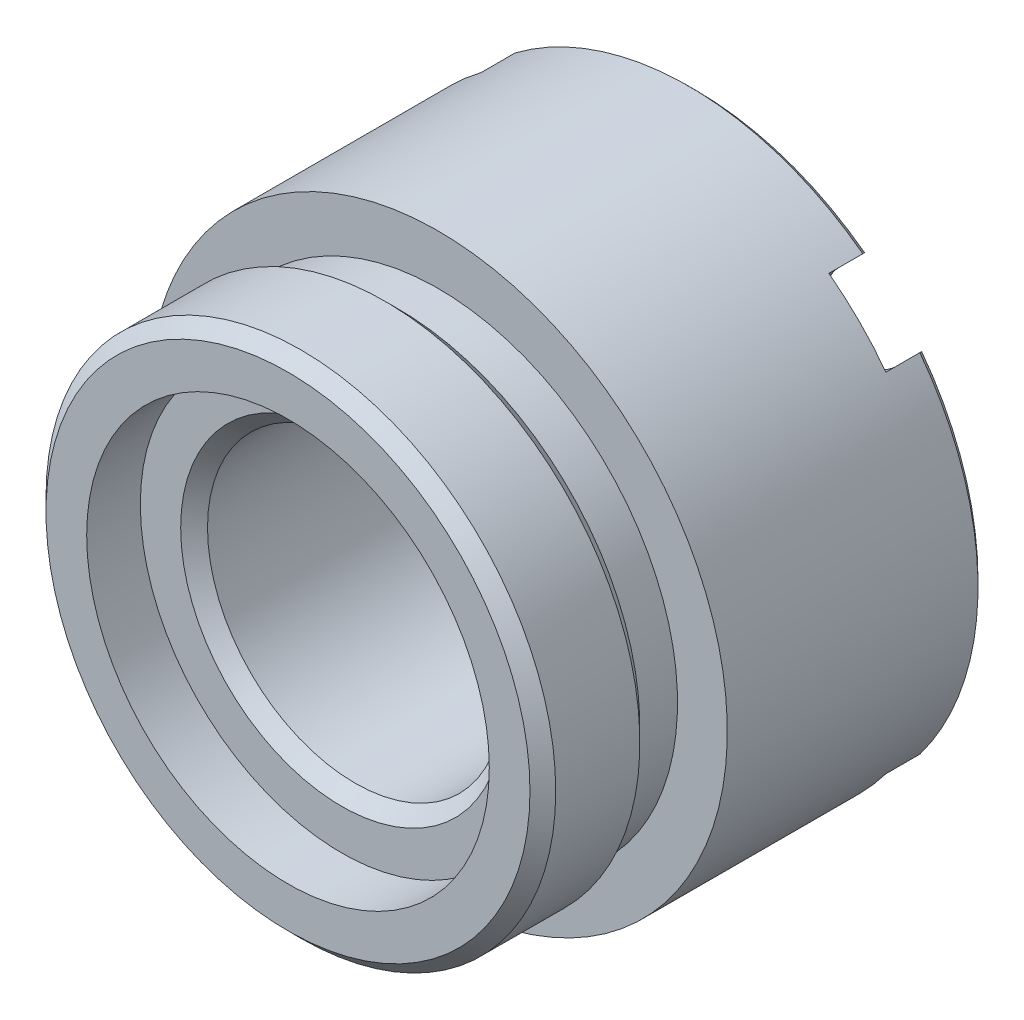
ISO-10303-21;
HEADER;
FILE_DESCRIPTION(('STEP AP214'),'2;1');
FILE_NAME('part.step','',(''),(''),'','','');
FILE_SCHEMA(('AUTOMOTIVE_DESIGN { 1 0 10303 214 1 1 1 1 }'));
ENDSEC;
DATA;
#1=APPLICATION_CONTEXT('core data for automotive mechanical design processes');
#2=APPLICATION_PROTOCOL_DEFINITION('international standard','automotive_design',2000,#1);
#3=PRODUCT_CONTEXT('',#1,'mechanical');
#4=PRODUCT('Part','Part','',(#3));
#5=PRODUCT_RELATED_PRODUCT_CATEGORY('part','',(#4));
#6=PRODUCT_DEFINITION_FORMATION('','',#4);
#7=PRODUCT_DEFINITION_CONTEXT('part definition',#1,'design');
#8=PRODUCT_DEFINITION('design','',#6,#7);
#9=PRODUCT_DEFINITION_SHAPE('','',#8);
#10=(LENGTH_UNIT() NAMED_UNIT(*) SI_UNIT(.MILLI.,.METRE.));
#11=(NAMED_UNIT(*) PLANE_ANGLE_UNIT() SI_UNIT($,.RADIAN.));
#12=(NAMED_UNIT(*) SI_UNIT($,.STERADIAN.) SOLID_ANGLE_UNIT());
#13=UNCERTAINTY_MEASURE_WITH_UNIT(LENGTH_MEASURE(1.E-05),#10,'distance_accuracy_value','');
#14=(GEOMETRIC_REPRESENTATION_CONTEXT(3) GLOBAL_UNCERTAINTY_ASSIGNED_CONTEXT((#13)) GLOBAL_UNIT_ASSIGNED_CONTEXT((#10,
#11,#12)) REPRESENTATION_CONTEXT('',''));
#15=CARTESIAN_POINT('',(0.,0.,0.));
#16=DIRECTION('',(0.,0.,1.));
#17=DIRECTION('',(1.,0.,0.));
#18=AXIS2_PLACEMENT_3D('',#15,#16,#17);
#19=CARTESIAN_POINT('',(0.,0.,-12.0523));
#20=DIRECTION('',(0.,0.,1.));
#21=DIRECTION('',(1.,0.,0.));
#22=AXIS2_PLACEMENT_3D('',#19,#20,#21);
#23=CONICAL_SURFACE('',#22,16.7259,0.785398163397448);
#24=CARTESIAN_POINT('',(10.0174456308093,13.3940219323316,-12.0525));
#25=CARTESIAN_POINT('',(10.0628537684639,13.4394300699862,-11.9889406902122));
#26=CARTESIAN_POINT('',(10.1082593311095,13.4848356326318,-11.9253777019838));
#27=CARTESIAN_POINT('',(10.1990653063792,13.5756416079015,-11.7982443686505));
#28=CARTESIAN_POINT('',(10.2444657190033,13.6210420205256,-11.7346740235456));
#29=CARTESIAN_POINT('',(10.2898635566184,13.6664398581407,-11.6711));
#30=B_SPLINE_CURVE_WITH_KNOTS('',3,(#24,#25,#26,#27,#28,#29),.UNSPECIFIED.,.F.,.F.,(4,2,4),(0.,
0.271057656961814,0.542115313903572),.UNSPECIFIED.);
#31=CARTESIAN_POINT('',(10.0175885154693,13.3941648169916,-12.0523));
#32=VERTEX_POINT('',#31);
#33=CARTESIAN_POINT('',(10.2897207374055,13.6662970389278,-11.6713));
#34=VERTEX_POINT('',#33);
#35=EDGE_CURVE('E208',#32,#34,#30,.T.);
#36=ORIENTED_EDGE('',*,*,#35,.F.);
#37=CARTESIAN_POINT('',(0.,0.,-12.0523));
#38=DIRECTION('',(0.,0.,-1.));
#39=DIRECTION('',(-1.,0.,0.));
#40=AXIS2_PLACEMENT_3D('',#37,#38,#39);
#41=CIRCLE('',#40,16.7259);
#42=CARTESIAN_POINT('',(-10.0175885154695,13.3941648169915,-12.0523));
#43=VERTEX_POINT('',#42);
#44=EDGE_CURVE('E248',#43,#32,#41,.T.);
#45=ORIENTED_EDGE('',*,*,#44,.F.);
#46=CARTESIAN_POINT('',(-10.2898635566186,13.6664398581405,-11.6711));
#47=CARTESIAN_POINT('',(-10.2444657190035,13.6210420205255,-11.7346740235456));
#48=CARTESIAN_POINT('',(-10.1990653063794,13.5756416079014,-11.7982443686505));
#49=CARTESIAN_POINT('',(-10.1082593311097,13.4848356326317,-11.9253777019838));
#50=CARTESIAN_POINT('',(-10.0628537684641,13.4394300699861,-11.9889406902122));
#51=CARTESIAN_POINT('',(-10.0174456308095,13.3940219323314,-12.0525));
#52=B_SPLINE_CURVE_WITH_KNOTS('',3,(#46,#47,#48,#49,#50,#51),.UNSPECIFIED.,.F.,.F.,(4,2,4),(0.,
0.271057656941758,0.542115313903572),.UNSPECIFIED.);
#53=CARTESIAN_POINT('',(-10.2897207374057,13.6662970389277,-11.6713));
#54=VERTEX_POINT('',#53);
#55=EDGE_CURVE('E46',#54,#43,#52,.T.);
#56=ORIENTED_EDGE('',*,*,#55,.F.);
#57=CARTESIAN_POINT('',(0.,0.,-11.6713));
#58=DIRECTION('',(0.,0.,-1.));
#59=DIRECTION('',(-1.,0.,0.));
#60=AXIS2_PLACEMENT_3D('',#57,#58,#59);
#61=CIRCLE('',#60,17.1069);
#62=EDGE_CURVE('E404',#34,#54,#61,.F.);
#63=ORIENTED_EDGE('',*,*,#62,.F.);
#64=EDGE_LOOP('',(#36,#45,#56,#63));
#65=FACE_BOUND('',#64,.T.);
#66=ADVANCED_FACE('F33',(#65),#23,.T.);
#67=CARTESIAN_POINT('',(13.6664398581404,10.2898635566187,-11.6711));
#68=CARTESIAN_POINT('',(13.6210420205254,10.2444657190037,-11.7346740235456));
#69=CARTESIAN_POINT('',(13.5756416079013,10.1990653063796,-11.7982443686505));
#70=CARTESIAN_POINT('',(13.4848356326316,10.1082593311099,-11.9253777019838));
#71=CARTESIAN_POINT('',(13.439430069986,10.0628537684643,-11.9889406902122));
#72=CARTESIAN_POINT('',(13.3940219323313,10.0174456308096,-12.0525));
#73=B_SPLINE_CURVE_WITH_KNOTS('',3,(#67,#68,#69,#70,#71,#72),.UNSPECIFIED.,.F.,.F.,(4,2,4),(0.,
0.271057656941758,0.542115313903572),.UNSPECIFIED.);
#74=CARTESIAN_POINT('',(13.6662970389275,10.2897207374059,-11.6713));
#75=VERTEX_POINT('',#74);
#76=CARTESIAN_POINT('',(13.3941648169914,10.0175885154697,-12.0523));
#77=VERTEX_POINT('',#76);
#78=EDGE_CURVE('E231',#75,#77,#73,.T.);
#79=ORIENTED_EDGE('',*,*,#78,.F.);
#80=CARTESIAN_POINT('',(13.6662970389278,-10.2897207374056,-11.6713));
#81=VERTEX_POINT('',#80);
#82=EDGE_CURVE('E197',#81,#75,#61,.F.);
#83=ORIENTED_EDGE('',*,*,#82,.F.);
#84=CARTESIAN_POINT('',(13.3940219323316,-10.0174456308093,-12.0525));
#85=CARTESIAN_POINT('',(13.4394300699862,-10.062853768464,-11.9889406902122));
#86=CARTESIAN_POINT('',(13.4848356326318,-10.1082593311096,-11.9253777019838));
#87=CARTESIAN_POINT('',(13.5756416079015,-10.1990653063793,-11.7982443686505));
#88=CARTESIAN_POINT('',(13.6210420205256,-10.2444657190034,-11.7346740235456));
#89=CARTESIAN_POINT('',(13.6664398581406,-10.2898635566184,-11.6711));
#90=B_SPLINE_CURVE_WITH_KNOTS('',3,(#84,#85,#86,#87,#88,#89),.UNSPECIFIED.,.F.,.F.,(4,2,4),(0.,
0.271057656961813,0.542115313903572),.UNSPECIFIED.);
#91=CARTESIAN_POINT('',(13.3941648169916,-10.0175885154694,-12.0523));
#92=VERTEX_POINT('',#91);
#93=EDGE_CURVE('E284',#92,#81,#90,.T.);
#94=ORIENTED_EDGE('',*,*,#93,.F.);
#95=EDGE_CURVE('E405',#77,#92,#41,.T.);
#96=ORIENTED_EDGE('',*,*,#95,.F.);
#97=EDGE_LOOP('',(#79,#83,#94,#96));
#98=FACE_BOUND('',#97,.T.);
#99=ADVANCED_FACE('F452',(#98),#23,.T.);
#100=CARTESIAN_POINT('',(10.2898635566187,-13.6664398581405,-11.6711));
#101=CARTESIAN_POINT('',(10.2444657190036,-13.6210420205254,-11.7346740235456));
#102=CARTESIAN_POINT('',(10.1990653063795,-13.5756416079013,-11.7982443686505));
#103=CARTESIAN_POINT('',(10.1082593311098,-13.4848356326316,-11.9253777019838));
#104=CARTESIAN_POINT('',(10.0628537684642,-13.439430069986,-11.9889406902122));
#105=CARTESIAN_POINT('',(10.0174456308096,-13.3940219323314,-12.0525));
#106=B_SPLINE_CURVE_WITH_KNOTS('',3,(#100,#101,#102,#103,#104,#105),.UNSPECIFIED.,.F.,.F.,(4,2,
4),(0.,0.271057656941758,0.542115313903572),.UNSPECIFIED.);
#107=CARTESIAN_POINT('',(10.2897207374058,-13.6662970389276,-11.6713));
#108=VERTEX_POINT('',#107);
#109=CARTESIAN_POINT('',(10.0175885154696,-13.3941648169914,-12.0523));
#110=VERTEX_POINT('',#109);
#111=EDGE_CURVE('E259',#108,#110,#106,.T.);
#112=ORIENTED_EDGE('',*,*,#111,.F.);
#113=CARTESIAN_POINT('',(-10.2897207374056,-13.6662970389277,-11.6713));
#114=VERTEX_POINT('',#113);
#115=EDGE_CURVE('E410',#114,#108,#61,.F.);
#116=ORIENTED_EDGE('',*,*,#115,.F.);
#117=CARTESIAN_POINT('',(-10.0174456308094,-13.3940219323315,-12.0525));
#118=CARTESIAN_POINT('',(-10.062853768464,-13.4394300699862,-11.9889406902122));
#119=CARTESIAN_POINT('',(-10.1082593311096,-13.4848356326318,-11.9253777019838));
#120=CARTESIAN_POINT('',(-10.1990653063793,-13.5756416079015,-11.7982443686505));
#121=CARTESIAN_POINT('',(-10.2444657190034,-13.6210420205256,-11.7346740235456));
#122=CARTESIAN_POINT('',(-10.2898635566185,-13.6664398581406,-11.6711));
#123=B_SPLINE_CURVE_WITH_KNOTS('',3,(#117,#118,#119,#120,#121,#122),.UNSPECIFIED.,.F.,.F.,(4,2,
4),(0.,0.271057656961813,0.542115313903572),.UNSPECIFIED.);
#124=CARTESIAN_POINT('',(-10.0175885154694,-13.3941648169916,-12.0523));
#125=VERTEX_POINT('',#124);
#126=EDGE_CURVE('E330',#125,#114,#123,.T.);
#127=ORIENTED_EDGE('',*,*,#126,.F.);
#128=EDGE_CURVE('E490',#110,#125,#41,.T.);
#129=ORIENTED_EDGE('',*,*,#128,.F.);
#130=EDGE_LOOP('',(#112,#116,#127,#129));
#131=FACE_BOUND('',#130,.T.);
#132=ADVANCED_FACE('F448',(#131),#23,.T.);
#133=CARTESIAN_POINT('',(0.,0.,-12.0523));
#134=DIRECTION('',(0.,0.,-1.));
#135=DIRECTION('',(-1.,0.,0.));
#136=AXIS2_PLACEMENT_3D('',#133,#134,#135);
#137=PLANE('',#136);
#138=DIRECTION('',(0.707106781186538,0.707106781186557,0.));
#139=VECTOR('',#138,1.);
#140=CARTESIAN_POINT('',(10.2897207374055,13.6662970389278,-12.0523));
#141=LINE('',#140,#139);
#142=CARTESIAN_POINT('',(8.45042100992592,11.8269973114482,-12.0523));
#143=VERTEX_POINT('',#142);
#144=EDGE_CURVE('E245',#143,#32,#141,.T.);
#145=ORIENTED_EDGE('',*,*,#144,.F.);
#146=CARTESIAN_POINT('',(10.1387091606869,10.1387091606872,-12.0523));
#147=DIRECTION('',(0.,0.,-1.));
#148=DIRECTION('',(0.,1.,0.));
#149=AXIS2_PLACEMENT_3D('',#146,#147,#148);
#150=CIRCLE('',#149,2.3876);
#151=CARTESIAN_POINT('',(11.826997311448,8.45042100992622,-12.0523));
#152=VERTEX_POINT('',#151);
#153=EDGE_CURVE('E198',#152,#143,#150,.T.);
#154=ORIENTED_EDGE('',*,*,#153,.F.);
#155=DIRECTION('',(-0.707106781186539,-0.707106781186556,0.));
#156=VECTOR('',#155,1.);
#157=CARTESIAN_POINT('',(13.6662970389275,10.2897207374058,-12.0523));
#158=LINE('',#157,#156);
#159=EDGE_CURVE('E202',#77,#152,#158,.T.);
#160=ORIENTED_EDGE('',*,*,#159,.F.);
#161=ORIENTED_EDGE('',*,*,#95,.T.);
#162=DIRECTION('',(0.707106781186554,-0.707106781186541,0.));
#163=VECTOR('',#162,1.);
#164=CARTESIAN_POINT('',(13.6662970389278,-10.2897207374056,-12.0523));
#165=LINE('',#164,#163);
#166=CARTESIAN_POINT('',(11.8269973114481,-8.45042100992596,-12.0523));
#167=VERTEX_POINT('',#166);
#168=EDGE_CURVE('E293',#167,#92,#165,.T.);
#169=ORIENTED_EDGE('',*,*,#168,.F.);
#170=CARTESIAN_POINT('',(10.1387091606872,-10.138709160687,-12.0523));
#171=DIRECTION('',(0.,0.,-1.));
#172=DIRECTION('',(1.,0.,0.));
#173=AXIS2_PLACEMENT_3D('',#170,#171,#172);
#174=CIRCLE('',#173,2.3876);
#175=CARTESIAN_POINT('',(8.45042100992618,-11.826997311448,-12.0523));
#176=VERTEX_POINT('',#175);
#177=EDGE_CURVE('E507',#176,#167,#174,.T.);
#178=ORIENTED_EDGE('',*,*,#177,.F.);
#179=DIRECTION('',(-0.707106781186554,0.707106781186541,0.));
#180=VECTOR('',#179,1.);
#181=CARTESIAN_POINT('',(10.2897207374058,-13.6662970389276,-12.0523));
#182=LINE('',#181,#180);
#183=EDGE_CURVE('E266',#110,#176,#182,.T.);
#184=ORIENTED_EDGE('',*,*,#183,.F.);
#185=ORIENTED_EDGE('',*,*,#128,.T.);
#186=DIRECTION('',(-0.707106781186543,-0.707106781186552,0.));
#187=VECTOR('',#186,1.);
#188=CARTESIAN_POINT('',(-10.2897207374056,-13.6662970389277,-12.0523));
#189=LINE('',#188,#187);
#190=CARTESIAN_POINT('',(-8.45042100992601,-11.8269973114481,-12.0523));
#191=VERTEX_POINT('',#190);
#192=EDGE_CURVE('E341',#191,#125,#189,.T.);
#193=ORIENTED_EDGE('',*,*,#192,.F.);
#194=CARTESIAN_POINT('',(-10.138709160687,-10.1387091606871,-12.0523));
#195=DIRECTION('',(0.,0.,-1.));
#196=DIRECTION('',(0.,-1.,0.));
#197=AXIS2_PLACEMENT_3D('',#194,#195,#196);
#198=CIRCLE('',#197,2.3876);
#199=CARTESIAN_POINT('',(-11.826997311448,-8.45042100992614,-12.0523));
#200=VERTEX_POINT('',#199);
#201=EDGE_CURVE('E479',#200,#191,#198,.T.);
#202=ORIENTED_EDGE('',*,*,#201,.F.);
#203=DIRECTION('',(0.707106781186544,0.707106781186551,0.));
#204=VECTOR('',#203,1.);
#205=CARTESIAN_POINT('',(-13.6662970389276,-10.2897207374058,-12.0523));
#206=LINE('',#205,#204);
#207=CARTESIAN_POINT('',(-13.3941648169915,-10.0175885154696,-12.0523));
#208=VERTEX_POINT('',#207);
#209=EDGE_CURVE('E311',#208,#200,#206,.T.);
#210=ORIENTED_EDGE('',*,*,#209,.F.);
#211=CARTESIAN_POINT('',(-13.3941648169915,10.0175885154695,-12.0523));
#212=VERTEX_POINT('',#211);
#213=EDGE_CURVE('E402',#208,#212,#41,.T.);
#214=ORIENTED_EDGE('',*,*,#213,.T.);
#215=DIRECTION('',(-0.70710678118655,0.707106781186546,0.));
#216=VECTOR('',#215,1.);
#217=CARTESIAN_POINT('',(-13.6662970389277,10.2897207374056,-12.0523));
#218=LINE('',#217,#216);
#219=CARTESIAN_POINT('',(-11.8269973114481,8.45042100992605,-12.0523));
#220=VERTEX_POINT('',#219);
#221=EDGE_CURVE('E349',#220,#212,#218,.T.);
#222=ORIENTED_EDGE('',*,*,#221,.F.);
#223=CARTESIAN_POINT('',(-10.1387091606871,10.138709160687,-12.0523));
#224=DIRECTION('',(0.,0.,-1.));
#225=DIRECTION('',(-1.,0.,0.));
#226=AXIS2_PLACEMENT_3D('',#223,#224,#225);
#227=CIRCLE('',#226,2.3876);
#228=CARTESIAN_POINT('',(-8.4504210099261,11.826997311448,-12.0523));
#229=VERTEX_POINT('',#228);
#230=EDGE_CURVE('E346',#229,#220,#227,.T.);
#231=ORIENTED_EDGE('',*,*,#230,.F.);
#232=DIRECTION('',(0.707106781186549,-0.707106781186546,0.));
#233=VECTOR('',#232,1.);
#234=CARTESIAN_POINT('',(-10.2897207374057,13.6662970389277,-12.0523));
#235=LINE('',#234,#233);
#236=EDGE_CURVE('E344',#43,#229,#235,.T.);
#237=ORIENTED_EDGE('',*,*,#236,.F.);
#238=ORIENTED_EDGE('',*,*,#44,.T.);
#239=EDGE_LOOP('',(#145,#154,#160,#161,#169,#178,#184,#185,#193,#202,#210,#214,#222,#231,#237,#238));
#240=FACE_BOUND('',#239,.T.);
#241=CARTESIAN_POINT('',(0.,0.,-12.0523));
#242=DIRECTION('',(0.,0.,-1.));
#243=DIRECTION('',(-1.,0.,0.));
#244=AXIS2_PLACEMENT_3D('',#241,#242,#243);
#245=CIRCLE('',#244,9.52499999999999);
#246=CARTESIAN_POINT('',(-9.52499999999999,0.,-12.0523));
#247=VERTEX_POINT('',#246);
#248=EDGE_CURVE('E390',#247,#247,#245,.F.);
#249=ORIENTED_EDGE('',*,*,#248,.T.);
#250=EDGE_LOOP('',(#249));
#251=FACE_BOUND('',#250,.T.);
#252=ADVANCED_FACE('F35',(#240,#251),#137,.T.);
#253=CARTESIAN_POINT('',(0.,0.,-63.7141652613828));
#254=DIRECTION('',(0.,0.,-1.));
#255=DIRECTION('',(-1.,0.,0.));
#256=AXIS2_PLACEMENT_3D('',#253,#254,#255);
#257=CYLINDRICAL_SURFACE('',#256,17.1069);
#258=DIRECTION('',(0.,0.,-1.));
#259=VECTOR('',#258,1.);
#260=CARTESIAN_POINT('',(10.2897207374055,13.6662970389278,-9.6647));
#261=LINE('',#260,#259);
#262=CARTESIAN_POINT('',(10.2897207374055,13.6662970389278,-9.6647));
#263=VERTEX_POINT('',#262);
#264=EDGE_CURVE('E53',#263,#34,#261,.T.);
#265=ORIENTED_EDGE('',*,*,#264,.T.);
#266=ORIENTED_EDGE('',*,*,#62,.T.);
#267=DIRECTION('',(0.,0.,-1.));
#268=VECTOR('',#267,1.);
#269=CARTESIAN_POINT('',(-10.2897207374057,13.6662970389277,-9.6647));
#270=LINE('',#269,#268);
#271=CARTESIAN_POINT('',(-10.2897207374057,13.6662970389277,-9.6647));
#272=VERTEX_POINT('',#271);
#273=EDGE_CURVE('E364',#272,#54,#270,.T.);
#274=ORIENTED_EDGE('',*,*,#273,.F.);
#275=CARTESIAN_POINT('',(0.,0.,-9.6647));
#276=DIRECTION('',(0.,0.,-1.));
#277=DIRECTION('',(-1.,0.,0.));
#278=AXIS2_PLACEMENT_3D('',#275,#276,#277);
#279=CIRCLE('',#278,17.1069);
#280=CARTESIAN_POINT('',(-13.6662970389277,10.2897207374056,-9.6647));
#281=VERTEX_POINT('',#280);
#282=EDGE_CURVE('E352',#281,#272,#279,.T.);
#283=ORIENTED_EDGE('',*,*,#282,.F.);
#284=DIRECTION('',(0.,0.,-1.));
#285=VECTOR('',#284,1.);
#286=CARTESIAN_POINT('',(-13.6662970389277,10.2897207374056,-9.6647));
#287=LINE('',#286,#285);
#288=CARTESIAN_POINT('',(-13.6662970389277,10.2897207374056,-11.6713));
#289=VERTEX_POINT('',#288);
#290=EDGE_CURVE('E365',#281,#289,#287,.T.);
#291=ORIENTED_EDGE('',*,*,#290,.T.);
#292=CARTESIAN_POINT('',(-13.6662970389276,-10.2897207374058,-11.6713));
#293=VERTEX_POINT('',#292);
#294=EDGE_CURVE('E406',#289,#293,#61,.F.);
#295=ORIENTED_EDGE('',*,*,#294,.T.);
#296=DIRECTION('',(0.,0.,-1.));
#297=VECTOR('',#296,1.);
#298=CARTESIAN_POINT('',(-13.6662970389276,-10.2897207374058,-9.6647));
#299=LINE('',#298,#297);
#300=CARTESIAN_POINT('',(-13.6662970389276,-10.2897207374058,-9.6647));
#301=VERTEX_POINT('',#300);
#302=EDGE_CURVE('E475',#301,#293,#299,.T.);
#303=ORIENTED_EDGE('',*,*,#302,.F.);
#304=CARTESIAN_POINT('',(0.,0.,-9.6647));
#305=DIRECTION('',(0.,0.,-1.));
#306=DIRECTION('',(0.,-1.,0.));
#307=AXIS2_PLACEMENT_3D('',#304,#305,#306);
#308=CIRCLE('',#307,17.1069);
#309=CARTESIAN_POINT('',(-10.2897207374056,-13.6662970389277,-9.6647));
#310=VERTEX_POINT('',#309);
#311=EDGE_CURVE('E296',#310,#301,#308,.T.);
#312=ORIENTED_EDGE('',*,*,#311,.F.);
#313=DIRECTION('',(0.,0.,-1.));
#314=VECTOR('',#313,1.);
#315=CARTESIAN_POINT('',(-10.2897207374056,-13.6662970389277,-9.6647));
#316=LINE('',#315,#314);
#317=EDGE_CURVE('E336',#310,#114,#316,.T.);
#318=ORIENTED_EDGE('',*,*,#317,.T.);
#319=ORIENTED_EDGE('',*,*,#115,.T.);
#320=DIRECTION('',(0.,0.,-1.));
#321=VECTOR('',#320,1.);
#322=CARTESIAN_POINT('',(10.2897207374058,-13.6662970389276,-9.6647));
#323=LINE('',#322,#321);
#324=CARTESIAN_POINT('',(10.2897207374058,-13.6662970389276,-9.6647));
#325=VERTEX_POINT('',#324);
#326=EDGE_CURVE('E502',#325,#108,#323,.T.);
#327=ORIENTED_EDGE('',*,*,#326,.F.);
#328=CARTESIAN_POINT('',(0.,0.,-9.6647));
#329=DIRECTION('',(0.,0.,-1.));
#330=DIRECTION('',(1.,0.,0.));
#331=AXIS2_PLACEMENT_3D('',#328,#329,#330);
#332=CIRCLE('',#331,17.1069);
#333=CARTESIAN_POINT('',(13.6662970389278,-10.2897207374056,-9.6647));
#334=VERTEX_POINT('',#333);
#335=EDGE_CURVE('E250',#334,#325,#332,.T.);
#336=ORIENTED_EDGE('',*,*,#335,.F.);
#337=DIRECTION('',(0.,0.,-1.));
#338=VECTOR('',#337,1.);
#339=CARTESIAN_POINT('',(13.6662970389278,-10.2897207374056,-9.6647));
#340=LINE('',#339,#338);
#341=EDGE_CURVE('E61',#334,#81,#340,.T.);
#342=ORIENTED_EDGE('',*,*,#341,.T.);
#343=ORIENTED_EDGE('',*,*,#82,.T.);
#344=DIRECTION('',(0.,0.,-1.));
#345=VECTOR('',#344,1.);
#346=CARTESIAN_POINT('',(13.6662970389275,10.2897207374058,-9.6647));
#347=LINE('',#346,#345);
#348=CARTESIAN_POINT('',(13.6662970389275,10.2897207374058,-9.6647));
#349=VERTEX_POINT('',#348);
#350=EDGE_CURVE('E187',#349,#75,#347,.T.);
#351=ORIENTED_EDGE('',*,*,#350,.F.);
#352=CARTESIAN_POINT('',(0.,0.,-9.6647));
#353=DIRECTION('',(0.,0.,-1.));
#354=DIRECTION('',(0.,1.,0.));
#355=AXIS2_PLACEMENT_3D('',#352,#353,#354);
#356=CIRCLE('',#355,17.1069);
#357=EDGE_CURVE('E175',#263,#349,#356,.T.);
#358=ORIENTED_EDGE('',*,*,#357,.F.);
#359=EDGE_LOOP('',(#265,#266,#274,#283,#291,#295,#303,#312,#318,#319,#327,#336,#342,#343,#351,#358));
#360=FACE_BOUND('',#359,.T.);
#361=CARTESIAN_POINT('',(0.,0.,3.16230000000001));
#362=DIRECTION('',(0.,0.,-1.));
#363=DIRECTION('',(-1.,0.,0.));
#364=AXIS2_PLACEMENT_3D('',#361,#362,#363);
#365=CIRCLE('',#364,17.1069);
#366=CARTESIAN_POINT('',(-17.1069,0.,3.16230000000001));
#367=VERTEX_POINT('',#366);
#368=EDGE_CURVE('E387',#367,#367,#365,.T.);
#369=ORIENTED_EDGE('',*,*,#368,.T.);
#370=EDGE_LOOP('',(#369));
#371=FACE_BOUND('',#370,.T.);
#372=ADVANCED_FACE('F194',(#360,#371),#257,.T.);
#373=CARTESIAN_POINT('',(0.,17.1069,3.1623));
#374=DIRECTION('',(0.,0.,1.));
#375=DIRECTION('',(1.,0.,0.));
#376=AXIS2_PLACEMENT_3D('',#373,#374,#375);
#377=PLANE('',#376);
#378=CARTESIAN_POINT('',(0.,0.,3.16229999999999));
#379=DIRECTION('',(0.,0.,-1.));
#380=DIRECTION('',(-1.,0.,0.));
#381=AXIS2_PLACEMENT_3D('',#378,#379,#380);
#382=CIRCLE('',#381,14.1605);
#383=CARTESIAN_POINT('',(-14.1605,0.,3.16229999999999));
#384=VERTEX_POINT('',#383);
#385=EDGE_CURVE('E384',#384,#384,#382,.T.);
#386=ORIENTED_EDGE('',*,*,#385,.T.);
#387=EDGE_LOOP('',(#386));
#388=FACE_BOUND('',#387,.T.);
#389=ORIENTED_EDGE('',*,*,#368,.F.);
#390=EDGE_LOOP('',(#389));
#391=FACE_BOUND('',#390,.T.);
#392=ADVANCED_FACE('F714',(#388,#391),#377,.T.);
#393=CARTESIAN_POINT('',(0.,0.,-63.7141652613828));
#394=DIRECTION('',(0.,0.,-1.));
#395=DIRECTION('',(-1.,0.,0.));
#396=AXIS2_PLACEMENT_3D('',#393,#394,#395);
#397=CYLINDRICAL_SURFACE('',#396,14.1605);
#398=CARTESIAN_POINT('',(0.,0.,5.5499));
#399=DIRECTION('',(0.,0.,-1.));
#400=DIRECTION('',(-1.,0.,0.));
#401=AXIS2_PLACEMENT_3D('',#398,#399,#400);
#402=CIRCLE('',#401,14.1605);
#403=CARTESIAN_POINT('',(-14.1605,0.,5.5499));
#404=VERTEX_POINT('',#403);
#405=EDGE_CURVE('E381',#404,#404,#402,.T.);
#406=ORIENTED_EDGE('',*,*,#405,.T.);
#407=EDGE_LOOP('',(#406));
#408=FACE_BOUND('',#407,.T.);
#409=ORIENTED_EDGE('',*,*,#385,.F.);
#410=EDGE_LOOP('',(#409));
#411=FACE_BOUND('',#410,.T.);
#412=ADVANCED_FACE('F706',(#408,#411),#397,.T.);
#413=CARTESIAN_POINT('',(0.,14.1605,5.5499));
#414=DIRECTION('',(0.,0.,-1.));
#415=DIRECTION('',(-1.,0.,0.));
#416=AXIS2_PLACEMENT_3D('',#413,#414,#415);
#417=PLANE('',#416);
#418=CARTESIAN_POINT('',(0.,0.,5.5499));
#419=DIRECTION('',(0.,0.,-1.));
#420=DIRECTION('',(-1.,0.,0.));
#421=AXIS2_PLACEMENT_3D('',#418,#419,#420);
#422=CIRCLE('',#421,14.31925);
#423=CARTESIAN_POINT('',(-14.31925,0.,5.5499));
#424=VERTEX_POINT('',#423);
#425=EDGE_CURVE('E419',#424,#424,#422,.T.);
#426=ORIENTED_EDGE('',*,*,#425,.T.);
#427=EDGE_LOOP('',(#426));
#428=FACE_BOUND('',#427,.T.);
#429=ORIENTED_EDGE('',*,*,#405,.F.);
#430=EDGE_LOOP('',(#429));
#431=FACE_BOUND('',#430,.T.);
#432=ADVANCED_FACE('F698',(#428,#431),#417,.T.);
#433=CARTESIAN_POINT('',(0.,0.,-63.7141652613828));
#434=DIRECTION('',(0.,0.,-1.));
#435=DIRECTION('',(-1.,0.,0.));
#436=AXIS2_PLACEMENT_3D('',#433,#434,#435);
#437=CYLINDRICAL_SURFACE('',#436,15.08125);
#438=CARTESIAN_POINT('',(0.,0.,11.2903));
#439=DIRECTION('',(0.,0.,1.));
#440=DIRECTION('',(1.,0.,0.));
#441=AXIS2_PLACEMENT_3D('',#438,#439,#440);
#442=CIRCLE('',#441,15.08125);
#443=CARTESIAN_POINT('',(15.08125,0.,11.2903));
#444=VERTEX_POINT('',#443);
#445=EDGE_CURVE('E413',#444,#444,#442,.F.);
#446=ORIENTED_EDGE('',*,*,#445,.T.);
#447=EDGE_LOOP('',(#446));
#448=FACE_BOUND('',#447,.T.);
#449=CARTESIAN_POINT('',(0.,0.,6.3119));
#450=DIRECTION('',(0.,0.,-1.));
#451=DIRECTION('',(-1.,0.,0.));
#452=AXIS2_PLACEMENT_3D('',#449,#450,#451);
#453=CIRCLE('',#452,15.08125);
#454=CARTESIAN_POINT('',(-15.08125,0.,6.3119));
#455=VERTEX_POINT('',#454);
#456=EDGE_CURVE('E409',#455,#455,#453,.F.);
#457=ORIENTED_EDGE('',*,*,#456,.T.);
#458=EDGE_LOOP('',(#457));
#459=FACE_BOUND('',#458,.T.);
#460=ADVANCED_FACE('F689',(#448,#459),#437,.T.);
#461=CARTESIAN_POINT('',(0.,15.08125,12.0523));
#462=DIRECTION('',(0.,0.,1.));
#463=DIRECTION('',(1.,0.,0.));
#464=AXIS2_PLACEMENT_3D('',#461,#462,#463);
#465=PLANE('',#464);
#466=CARTESIAN_POINT('',(0.,0.,12.0523));
#467=DIRECTION('',(0.,0.,1.));
#468=DIRECTION('',(1.,0.,0.));
#469=AXIS2_PLACEMENT_3D('',#466,#467,#468);
#470=CIRCLE('',#469,14.31925);
#471=CARTESIAN_POINT('',(14.31925,0.,12.0523));
#472=VERTEX_POINT('',#471);
#473=EDGE_CURVE('E416',#472,#472,#470,.T.);
#474=ORIENTED_EDGE('',*,*,#473,.T.);
#475=EDGE_LOOP('',(#474));
#476=FACE_BOUND('',#475,.T.);
#477=CARTESIAN_POINT('',(0.,0.,12.0523));
#478=DIRECTION('',(0.,0.,1.));
#479=DIRECTION('',(1.,0.,0.));
#480=AXIS2_PLACEMENT_3D('',#477,#478,#479);
#481=CIRCLE('',#480,11.9126);
#482=CARTESIAN_POINT('',(11.9126,0.,12.0523));
#483=VERTEX_POINT('',#482);
#484=EDGE_CURVE('E368',#483,#483,#481,.T.);
#485=ORIENTED_EDGE('',*,*,#484,.F.);
#486=EDGE_LOOP('',(#485));
#487=FACE_BOUND('',#486,.T.);
#488=ADVANCED_FACE('F681',(#476,#487),#465,.T.);
#489=CARTESIAN_POINT('',(0.,0.,8.8773));
#490=DIRECTION('',(0.,0.,-1.));
#491=DIRECTION('',(-1.,0.,0.));
#492=AXIS2_PLACEMENT_3D('',#489,#490,#491);
#493=PLANE('',#492);
#494=CARTESIAN_POINT('',(0.,0.,8.8773));
#495=DIRECTION('',(0.,0.,-1.));
#496=DIRECTION('',(-1.,0.,0.));
#497=AXIS2_PLACEMENT_3D('',#494,#495,#496);
#498=CIRCLE('',#497,9.52499999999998);
#499=CARTESIAN_POINT('',(-9.52499999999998,0.,8.8773));
#500=VERTEX_POINT('',#499);
#501=EDGE_CURVE('E399',#500,#500,#498,.T.);
#502=ORIENTED_EDGE('',*,*,#501,.T.);
#503=EDGE_LOOP('',(#502));
#504=FACE_BOUND('',#503,.T.);
#505=CARTESIAN_POINT('',(0.,0.,8.8773));
#506=DIRECTION('',(0.,0.,1.));
#507=DIRECTION('',(1.,0.,0.));
#508=AXIS2_PLACEMENT_3D('',#505,#506,#507);
#509=CIRCLE('',#508,11.9126);
#510=CARTESIAN_POINT('',(11.9126,0.,8.8773));
#511=VERTEX_POINT('',#510);
#512=EDGE_CURVE('E378',#511,#511,#509,.T.);
#513=ORIENTED_EDGE('',*,*,#512,.T.);
#514=EDGE_LOOP('',(#513));
#515=FACE_BOUND('',#514,.T.);
#516=ADVANCED_FACE('F672',(#504,#515),#493,.F.);
#517=CARTESIAN_POINT('',(0.,0.,12.0523));
#518=DIRECTION('',(0.,0.,1.));
#519=DIRECTION('',(1.,0.,0.));
#520=AXIS2_PLACEMENT_3D('',#517,#518,#519);
#521=CYLINDRICAL_SURFACE('',#520,11.9126);
#522=ORIENTED_EDGE('',*,*,#512,.F.);
#523=EDGE_LOOP('',(#522));
#524=FACE_BOUND('',#523,.T.);
#525=ORIENTED_EDGE('',*,*,#484,.T.);
#526=EDGE_LOOP('',(#525));
#527=FACE_BOUND('',#526,.T.);
#528=ADVANCED_FACE('F662',(#524,#527),#521,.F.);
#529=CARTESIAN_POINT('',(0.,0.,8.8773));
#530=DIRECTION('',(0.,0.,1.));
#531=DIRECTION('',(1.,0.,0.));
#532=AXIS2_PLACEMENT_3D('',#529,#530,#531);
#533=CYLINDRICAL_SURFACE('',#532,8.73124999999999);
#534=CARTESIAN_POINT('',(0.,0.,-11.25855));
#535=DIRECTION('',(0.,0.,-1.));
#536=DIRECTION('',(-1.,0.,0.));
#537=AXIS2_PLACEMENT_3D('',#534,#535,#536);
#538=CIRCLE('',#537,8.73124999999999);
#539=CARTESIAN_POINT('',(-8.73124999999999,0.,-11.25855));
#540=VERTEX_POINT('',#539);
#541=EDGE_CURVE('E396',#540,#540,#538,.T.);
#542=ORIENTED_EDGE('',*,*,#541,.T.);
#543=EDGE_LOOP('',(#542));
#544=FACE_BOUND('',#543,.T.);
#545=CARTESIAN_POINT('',(0.,0.,8.08355));
#546=DIRECTION('',(0.,0.,-1.));
#547=DIRECTION('',(-1.,0.,0.));
#548=AXIS2_PLACEMENT_3D('',#545,#546,#547);
#549=CIRCLE('',#548,8.73124999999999);
#550=CARTESIAN_POINT('',(-8.73124999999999,0.,8.08355));
#551=VERTEX_POINT('',#550);
#552=EDGE_CURVE('E393',#551,#551,#549,.F.);
#553=ORIENTED_EDGE('',*,*,#552,.T.);
#554=EDGE_LOOP('',(#553));
#555=FACE_BOUND('',#554,.T.);
#556=ADVANCED_FACE('F653',(#544,#555),#533,.F.);
#557=CARTESIAN_POINT('',(0.,0.,-12.0523));
#558=DIRECTION('',(0.,0.,-1.));
#559=DIRECTION('',(-1.,0.,0.));
#560=AXIS2_PLACEMENT_3D('',#557,#558,#559);
#561=CONICAL_SURFACE('',#560,9.52499999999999,0.785398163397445);
#562=ORIENTED_EDGE('',*,*,#541,.F.);
#563=EDGE_LOOP('',(#562));
#564=FACE_BOUND('',#563,.T.);
#565=ORIENTED_EDGE('',*,*,#248,.F.);
#566=EDGE_LOOP('',(#565));
#567=FACE_BOUND('',#566,.T.);
#568=ADVANCED_FACE('F644',(#564,#567),#561,.F.);
#569=CARTESIAN_POINT('',(0.,0.,8.08355));
#570=DIRECTION('',(0.,0.,1.));
#571=DIRECTION('',(1.,0.,0.));
#572=AXIS2_PLACEMENT_3D('',#569,#570,#571);
#573=CONICAL_SURFACE('',#572,8.73124999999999,0.785398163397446);
#574=ORIENTED_EDGE('',*,*,#501,.F.);
#575=EDGE_LOOP('',(#574));
#576=FACE_BOUND('',#575,.T.);
#577=ORIENTED_EDGE('',*,*,#552,.F.);
#578=EDGE_LOOP('',(#577));
#579=FACE_BOUND('',#578,.T.);
#580=ADVANCED_FACE('F446',(#576,#579),#573,.F.);
#581=CARTESIAN_POINT('',(-13.6664398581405,-10.2898635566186,-11.6711));
#582=CARTESIAN_POINT('',(-13.6210420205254,-10.2444657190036,-11.7346740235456));
#583=CARTESIAN_POINT('',(-13.5756416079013,-10.1990653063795,-11.7982443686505));
#584=CARTESIAN_POINT('',(-13.4848356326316,-10.1082593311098,-11.9253777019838));
#585=CARTESIAN_POINT('',(-13.4394300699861,-10.0628537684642,-11.9889406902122));
#586=CARTESIAN_POINT('',(-13.3940219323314,-10.0174456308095,-12.0525));
#587=B_SPLINE_CURVE_WITH_KNOTS('',3,(#581,#582,#583,#584,#585,#586),.UNSPECIFIED.,.F.,.F.,(4,2,
4),(0.,0.271057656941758,0.542115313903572),.UNSPECIFIED.);
#588=EDGE_CURVE('E304',#293,#208,#587,.T.);
#589=ORIENTED_EDGE('',*,*,#588,.F.);
#590=ORIENTED_EDGE('',*,*,#294,.F.);
#591=CARTESIAN_POINT('',(-13.3940219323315,10.0174456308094,-12.0525));
#592=CARTESIAN_POINT('',(-13.4394300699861,10.0628537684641,-11.9889406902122));
#593=CARTESIAN_POINT('',(-13.4848356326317,10.1082593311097,-11.9253777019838));
#594=CARTESIAN_POINT('',(-13.5756416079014,10.1990653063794,-11.7982443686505));
#595=CARTESIAN_POINT('',(-13.6210420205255,10.2444657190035,-11.7346740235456));
#596=CARTESIAN_POINT('',(-13.6664398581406,10.2898635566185,-11.6711));
#597=B_SPLINE_CURVE_WITH_KNOTS('',3,(#591,#592,#593,#594,#595,#596),.UNSPECIFIED.,.F.,.F.,(4,2,
4),(0.,0.271057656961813,0.542115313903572),.UNSPECIFIED.);
#598=EDGE_CURVE('E11',#212,#289,#597,.T.);
#599=ORIENTED_EDGE('',*,*,#598,.F.);
#600=ORIENTED_EDGE('',*,*,#213,.F.);
#601=EDGE_LOOP('',(#589,#590,#599,#600));
#602=FACE_BOUND('',#601,.T.);
#603=ADVANCED_FACE('F425',(#602),#23,.T.);
#604=CARTESIAN_POINT('',(0.,0.,11.2903));
#605=DIRECTION('',(0.,0.,-1.));
#606=DIRECTION('',(-1.,0.,0.));
#607=AXIS2_PLACEMENT_3D('',#604,#605,#606);
#608=CONICAL_SURFACE('',#607,15.08125,0.785398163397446);
#609=ORIENTED_EDGE('',*,*,#473,.F.);
#610=EDGE_LOOP('',(#609));
#611=FACE_BOUND('',#610,.T.);
#612=ORIENTED_EDGE('',*,*,#445,.F.);
#613=EDGE_LOOP('',(#612));
#614=FACE_BOUND('',#613,.T.);
#615=ADVANCED_FACE('F439',(#611,#614),#608,.T.);
#616=CARTESIAN_POINT('',(0.,0.,5.5499));
#617=DIRECTION('',(0.,0.,1.));
#618=DIRECTION('',(1.,0.,0.));
#619=AXIS2_PLACEMENT_3D('',#616,#617,#618);
#620=CONICAL_SURFACE('',#619,14.31925,0.785398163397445);
#621=ORIENTED_EDGE('',*,*,#456,.F.);
#622=EDGE_LOOP('',(#621));
#623=FACE_BOUND('',#622,.T.);
#624=ORIENTED_EDGE('',*,*,#425,.F.);
#625=EDGE_LOOP('',(#624));
#626=FACE_BOUND('',#625,.T.);
#627=ADVANCED_FACE('F436',(#623,#626),#620,.T.);
#628=CARTESIAN_POINT('',(-13.6662970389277,10.2897207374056,-9.6647));
#629=DIRECTION('',(-0.707106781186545,-0.707106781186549,0.));
#630=DIRECTION('',(0.70710678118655,-0.707106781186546,0.));
#631=AXIS2_PLACEMENT_3D('',#628,#629,#630);
#632=PLANE('',#631);
#633=ORIENTED_EDGE('',*,*,#598,.T.);
#634=ORIENTED_EDGE('',*,*,#290,.F.);
#635=DIRECTION('',(-0.70710678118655,0.707106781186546,0.));
#636=VECTOR('',#635,1.);
#637=CARTESIAN_POINT('',(-13.6662970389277,10.2897207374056,-9.6647));
#638=LINE('',#637,#636);
#639=CARTESIAN_POINT('',(-11.8269973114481,8.45042100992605,-9.6647));
#640=VERTEX_POINT('',#639);
#641=EDGE_CURVE('E361',#640,#281,#638,.T.);
#642=ORIENTED_EDGE('',*,*,#641,.F.);
#643=DIRECTION('',(0.,0.,-1.));
#644=VECTOR('',#643,1.);
#645=CARTESIAN_POINT('',(-11.8269973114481,8.45042100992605,-9.6647));
#646=LINE('',#645,#644);
#647=EDGE_CURVE('E369',#640,#220,#646,.T.);
#648=ORIENTED_EDGE('',*,*,#647,.T.);
#649=ORIENTED_EDGE('',*,*,#221,.T.);
#650=EDGE_LOOP('',(#633,#634,#642,#648,#649));
#651=FACE_BOUND('',#650,.T.);
#652=ADVANCED_FACE('F438',(#651),#632,.F.);
#653=CARTESIAN_POINT('',(-10.1387091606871,10.138709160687,-9.6647));
#654=DIRECTION('',(0.,0.,-1.));
#655=DIRECTION('',(-1.,0.,0.));
#656=AXIS2_PLACEMENT_3D('',#653,#654,#655);
#657=CYLINDRICAL_SURFACE('',#656,2.3876);
#658=ORIENTED_EDGE('',*,*,#230,.T.);
#659=ORIENTED_EDGE('',*,*,#647,.F.);
#660=CARTESIAN_POINT('',(-10.1387091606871,10.138709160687,-9.6647));
#661=DIRECTION('',(0.,0.,-1.));
#662=DIRECTION('',(-1.,0.,0.));
#663=AXIS2_PLACEMENT_3D('',#660,#661,#662);
#664=CIRCLE('',#663,2.3876);
#665=CARTESIAN_POINT('',(-8.4504210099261,11.826997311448,-9.6647));
#666=VERTEX_POINT('',#665);
#667=EDGE_CURVE('E358',#666,#640,#664,.T.);
#668=ORIENTED_EDGE('',*,*,#667,.F.);
#669=DIRECTION('',(0.,0.,-1.));
#670=VECTOR('',#669,1.);
#671=CARTESIAN_POINT('',(-8.4504210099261,11.826997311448,-9.6647));
#672=LINE('',#671,#670);
#673=EDGE_CURVE('E371',#666,#229,#672,.T.);
#674=ORIENTED_EDGE('',*,*,#673,.T.);
#675=EDGE_LOOP('',(#658,#659,#668,#674));
#676=FACE_BOUND('',#675,.T.);
#677=ADVANCED_FACE('F434',(#676),#657,.F.);
#678=CARTESIAN_POINT('',(-10.2897207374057,13.6662970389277,-9.6647));
#679=DIRECTION('',(0.707106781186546,0.707106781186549,0.));
#680=DIRECTION('',(-0.707106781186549,0.707106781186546,0.));
#681=AXIS2_PLACEMENT_3D('',#678,#679,#680);
#682=PLANE('',#681);
#683=ORIENTED_EDGE('',*,*,#55,.T.);
#684=ORIENTED_EDGE('',*,*,#236,.T.);
#685=ORIENTED_EDGE('',*,*,#673,.F.);
#686=DIRECTION('',(0.707106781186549,-0.707106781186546,0.));
#687=VECTOR('',#686,1.);
#688=CARTESIAN_POINT('',(-10.2897207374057,13.6662970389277,-9.6647));
#689=LINE('',#688,#687);
#690=EDGE_CURVE('E355',#272,#666,#689,.T.);
#691=ORIENTED_EDGE('',*,*,#690,.F.);
#692=ORIENTED_EDGE('',*,*,#273,.T.);
#693=EDGE_LOOP('',(#683,#684,#685,#691,#692));
#694=FACE_BOUND('',#693,.T.);
#695=ADVANCED_FACE('F429',(#694),#682,.F.);
#696=CARTESIAN_POINT('',(0.,0.,-9.6647));
#697=DIRECTION('',(0.,0.,-1.));
#698=DIRECTION('',(-1.,0.,0.));
#699=AXIS2_PLACEMENT_3D('',#696,#697,#698);
#700=PLANE('',#699);
#701=ORIENTED_EDGE('',*,*,#282,.T.);
#702=ORIENTED_EDGE('',*,*,#690,.T.);
#703=ORIENTED_EDGE('',*,*,#667,.T.);
#704=ORIENTED_EDGE('',*,*,#641,.T.);
#705=EDGE_LOOP('',(#701,#702,#703,#704));
#706=FACE_BOUND('',#705,.T.);
#707=ADVANCED_FACE('F327',(#706),#700,.T.);
#708=CARTESIAN_POINT('',(-10.2897207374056,-13.6662970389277,-9.6647));
#709=DIRECTION('',(0.707106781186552,-0.707106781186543,0.));
#710=DIRECTION('',(0.707106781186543,0.707106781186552,0.));
#711=AXIS2_PLACEMENT_3D('',#708,#709,#710);
#712=PLANE('',#711);
#713=ORIENTED_EDGE('',*,*,#126,.T.);
#714=ORIENTED_EDGE('',*,*,#317,.F.);
#715=DIRECTION('',(-0.707106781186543,-0.707106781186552,0.));
#716=VECTOR('',#715,1.);
#717=CARTESIAN_POINT('',(-10.2897207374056,-13.6662970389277,-9.6647));
#718=LINE('',#717,#716);
#719=CARTESIAN_POINT('',(-8.45042100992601,-11.8269973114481,-9.6647));
#720=VERTEX_POINT('',#719);
#721=EDGE_CURVE('E302',#720,#310,#718,.T.);
#722=ORIENTED_EDGE('',*,*,#721,.F.);
#723=DIRECTION('',(0.,0.,-1.));
#724=VECTOR('',#723,1.);
#725=CARTESIAN_POINT('',(-8.45042100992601,-11.8269973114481,-9.6647));
#726=LINE('',#725,#724);
#727=EDGE_CURVE('E337',#720,#191,#726,.T.);
#728=ORIENTED_EDGE('',*,*,#727,.T.);
#729=ORIENTED_EDGE('',*,*,#192,.T.);
#730=EDGE_LOOP('',(#713,#714,#722,#728,#729));
#731=FACE_BOUND('',#730,.T.);
#732=ADVANCED_FACE('F323',(#731),#712,.F.);
#733=CARTESIAN_POINT('',(-10.138709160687,-10.1387091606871,-9.6647));
#734=DIRECTION('',(0.,0.,-1.));
#735=DIRECTION('',(0.,-1.,0.));
#736=AXIS2_PLACEMENT_3D('',#733,#734,#735);
#737=CYLINDRICAL_SURFACE('',#736,2.3876);
#738=ORIENTED_EDGE('',*,*,#201,.T.);
#739=ORIENTED_EDGE('',*,*,#727,.F.);
#740=CARTESIAN_POINT('',(-10.138709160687,-10.1387091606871,-9.6647));
#741=DIRECTION('',(0.,0.,-1.));
#742=DIRECTION('',(0.,-1.,0.));
#743=AXIS2_PLACEMENT_3D('',#740,#741,#742);
#744=CIRCLE('',#743,2.3876);
#745=CARTESIAN_POINT('',(-11.826997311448,-8.45042100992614,-9.6647));
#746=VERTEX_POINT('',#745);
#747=EDGE_CURVE('E300',#746,#720,#744,.T.);
#748=ORIENTED_EDGE('',*,*,#747,.F.);
#749=DIRECTION('',(0.,0.,-1.));
#750=VECTOR('',#749,1.);
#751=CARTESIAN_POINT('',(-11.826997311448,-8.45042100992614,-9.6647));
#752=LINE('',#751,#750);
#753=EDGE_CURVE('E480',#746,#200,#752,.T.);
#754=ORIENTED_EDGE('',*,*,#753,.T.);
#755=EDGE_LOOP('',(#738,#739,#748,#754));
#756=FACE_BOUND('',#755,.T.);
#757=ADVANCED_FACE('F320',(#756),#737,.F.);
#758=CARTESIAN_POINT('',(-13.6662970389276,-10.2897207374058,-9.6647));
#759=DIRECTION('',(-0.707106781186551,0.707106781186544,0.));
#760=DIRECTION('',(-0.707106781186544,-0.707106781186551,0.));
#761=AXIS2_PLACEMENT_3D('',#758,#759,#760);
#762=PLANE('',#761);
#763=ORIENTED_EDGE('',*,*,#588,.T.);
#764=ORIENTED_EDGE('',*,*,#209,.T.);
#765=ORIENTED_EDGE('',*,*,#753,.F.);
#766=DIRECTION('',(0.707106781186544,0.707106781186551,0.));
#767=VECTOR('',#766,1.);
#768=CARTESIAN_POINT('',(-13.6662970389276,-10.2897207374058,-9.6647));
#769=LINE('',#768,#767);
#770=EDGE_CURVE('E298',#301,#746,#769,.T.);
#771=ORIENTED_EDGE('',*,*,#770,.F.);
#772=ORIENTED_EDGE('',*,*,#302,.T.);
#773=EDGE_LOOP('',(#763,#764,#765,#771,#772));
#774=FACE_BOUND('',#773,.T.);
#775=ADVANCED_FACE('F316',(#774),#762,.F.);
#776=CARTESIAN_POINT('',(0.,0.,-9.6647));
#777=DIRECTION('',(0.,0.,-1.));
#778=DIRECTION('',(0.,-1.,0.));
#779=AXIS2_PLACEMENT_3D('',#776,#777,#778);
#780=PLANE('',#779);
#781=ORIENTED_EDGE('',*,*,#311,.T.);
#782=ORIENTED_EDGE('',*,*,#770,.T.);
#783=ORIENTED_EDGE('',*,*,#747,.T.);
#784=ORIENTED_EDGE('',*,*,#721,.T.);
#785=EDGE_LOOP('',(#781,#782,#783,#784));
#786=FACE_BOUND('',#785,.T.);
#787=ADVANCED_FACE('F282',(#786),#780,.T.);
#788=CARTESIAN_POINT('',(13.6662970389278,-10.2897207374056,-9.6647));
#789=DIRECTION('',(0.707106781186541,0.707106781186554,0.));
#790=DIRECTION('',(-0.707106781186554,0.707106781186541,0.));
#791=AXIS2_PLACEMENT_3D('',#788,#789,#790);
#792=PLANE('',#791);
#793=ORIENTED_EDGE('',*,*,#93,.T.);
#794=ORIENTED_EDGE('',*,*,#341,.F.);
#795=DIRECTION('',(0.707106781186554,-0.707106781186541,0.));
#796=VECTOR('',#795,1.);
#797=CARTESIAN_POINT('',(13.6662970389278,-10.2897207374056,-9.6647));
#798=LINE('',#797,#796);
#799=CARTESIAN_POINT('',(11.8269973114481,-8.45042100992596,-9.6647));
#800=VERTEX_POINT('',#799);
#801=EDGE_CURVE('E257',#800,#334,#798,.T.);
#802=ORIENTED_EDGE('',*,*,#801,.F.);
#803=DIRECTION('',(0.,0.,-1.));
#804=VECTOR('',#803,1.);
#805=CARTESIAN_POINT('',(11.8269973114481,-8.45042100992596,-9.6647));
#806=LINE('',#805,#804);
#807=EDGE_CURVE('E290',#800,#167,#806,.T.);
#808=ORIENTED_EDGE('',*,*,#807,.T.);
#809=ORIENTED_EDGE('',*,*,#168,.T.);
#810=EDGE_LOOP('',(#793,#794,#802,#808,#809));
#811=FACE_BOUND('',#810,.T.);
#812=ADVANCED_FACE('F278',(#811),#792,.F.);
#813=CARTESIAN_POINT('',(10.1387091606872,-10.138709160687,-9.6647));
#814=DIRECTION('',(0.,0.,-1.));
#815=DIRECTION('',(1.,0.,0.));
#816=AXIS2_PLACEMENT_3D('',#813,#814,#815);
#817=CYLINDRICAL_SURFACE('',#816,2.3876);
#818=ORIENTED_EDGE('',*,*,#177,.T.);
#819=ORIENTED_EDGE('',*,*,#807,.F.);
#820=CARTESIAN_POINT('',(10.1387091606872,-10.138709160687,-9.6647));
#821=DIRECTION('',(0.,0.,-1.));
#822=DIRECTION('',(1.,0.,0.));
#823=AXIS2_PLACEMENT_3D('',#820,#821,#822);
#824=CIRCLE('',#823,2.3876);
#825=CARTESIAN_POINT('',(8.45042100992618,-11.826997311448,-9.6647));
#826=VERTEX_POINT('',#825);
#827=EDGE_CURVE('E255',#826,#800,#824,.T.);
#828=ORIENTED_EDGE('',*,*,#827,.F.);
#829=DIRECTION('',(0.,0.,-1.));
#830=VECTOR('',#829,1.);
#831=CARTESIAN_POINT('',(8.45042100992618,-11.826997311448,-9.6647));
#832=LINE('',#831,#830);
#833=EDGE_CURVE('E508',#826,#176,#832,.T.);
#834=ORIENTED_EDGE('',*,*,#833,.T.);
#835=EDGE_LOOP('',(#818,#819,#828,#834));
#836=FACE_BOUND('',#835,.T.);
#837=ADVANCED_FACE('F275',(#836),#817,.F.);
#838=CARTESIAN_POINT('',(10.2897207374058,-13.6662970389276,-9.6647));
#839=DIRECTION('',(-0.707106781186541,-0.707106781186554,0.));
#840=DIRECTION('',(0.707106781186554,-0.707106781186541,0.));
#841=AXIS2_PLACEMENT_3D('',#838,#839,#840);
#842=PLANE('',#841);
#843=ORIENTED_EDGE('',*,*,#111,.T.);
#844=ORIENTED_EDGE('',*,*,#183,.T.);
#845=ORIENTED_EDGE('',*,*,#833,.F.);
#846=DIRECTION('',(-0.707106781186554,0.707106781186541,0.));
#847=VECTOR('',#846,1.);
#848=CARTESIAN_POINT('',(10.2897207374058,-13.6662970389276,-9.6647));
#849=LINE('',#848,#847);
#850=EDGE_CURVE('E251',#325,#826,#849,.T.);
#851=ORIENTED_EDGE('',*,*,#850,.F.);
#852=ORIENTED_EDGE('',*,*,#326,.T.);
#853=EDGE_LOOP('',(#843,#844,#845,#851,#852));
#854=FACE_BOUND('',#853,.T.);
#855=ADVANCED_FACE('F271',(#854),#842,.F.);
#856=CARTESIAN_POINT('',(0.,0.,-9.6647));
#857=DIRECTION('',(0.,0.,-1.));
#858=DIRECTION('',(1.,0.,0.));
#859=AXIS2_PLACEMENT_3D('',#856,#857,#858);
#860=PLANE('',#859);
#861=ORIENTED_EDGE('',*,*,#335,.T.);
#862=ORIENTED_EDGE('',*,*,#850,.T.);
#863=ORIENTED_EDGE('',*,*,#827,.T.);
#864=ORIENTED_EDGE('',*,*,#801,.T.);
#865=EDGE_LOOP('',(#861,#862,#863,#864));
#866=FACE_BOUND('',#865,.T.);
#867=ADVANCED_FACE('F223',(#866),#860,.T.);
#868=CARTESIAN_POINT('',(10.2897207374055,13.6662970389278,-9.6647));
#869=DIRECTION('',(-0.707106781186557,0.707106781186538,0.));
#870=DIRECTION('',(-0.707106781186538,-0.707106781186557,0.));
#871=AXIS2_PLACEMENT_3D('',#868,#869,#870);
#872=PLANE('',#871);
#873=ORIENTED_EDGE('',*,*,#35,.T.);
#874=ORIENTED_EDGE('',*,*,#264,.F.);
#875=DIRECTION('',(0.707106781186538,0.707106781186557,0.));
#876=VECTOR('',#875,1.);
#877=CARTESIAN_POINT('',(10.2897207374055,13.6662970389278,-9.6647));
#878=LINE('',#877,#876);
#879=CARTESIAN_POINT('',(8.45042100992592,11.8269973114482,-9.6647));
#880=VERTEX_POINT('',#879);
#881=EDGE_CURVE('E180',#880,#263,#878,.T.);
#882=ORIENTED_EDGE('',*,*,#881,.F.);
#883=DIRECTION('',(0.,0.,-1.));
#884=VECTOR('',#883,1.);
#885=CARTESIAN_POINT('',(8.45042100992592,11.8269973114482,-9.6647));
#886=LINE('',#885,#884);
#887=EDGE_CURVE('E200',#880,#143,#886,.T.);
#888=ORIENTED_EDGE('',*,*,#887,.T.);
#889=ORIENTED_EDGE('',*,*,#144,.T.);
#890=EDGE_LOOP('',(#873,#874,#882,#888,#889));
#891=FACE_BOUND('',#890,.T.);
#892=ADVANCED_FACE('F218',(#891),#872,.F.);
#893=CARTESIAN_POINT('',(10.1387091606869,10.1387091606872,-9.6647));
#894=DIRECTION('',(0.,0.,-1.));
#895=DIRECTION('',(0.,1.,0.));
#896=AXIS2_PLACEMENT_3D('',#893,#894,#895);
#897=CYLINDRICAL_SURFACE('',#896,2.3876);
#898=ORIENTED_EDGE('',*,*,#153,.T.);
#899=ORIENTED_EDGE('',*,*,#887,.F.);
#900=CARTESIAN_POINT('',(10.1387091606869,10.1387091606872,-9.6647));
#901=DIRECTION('',(0.,0.,-1.));
#902=DIRECTION('',(0.,1.,0.));
#903=AXIS2_PLACEMENT_3D('',#900,#901,#902);
#904=CIRCLE('',#903,2.3876);
#905=CARTESIAN_POINT('',(11.826997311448,8.45042100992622,-9.6647));
#906=VERTEX_POINT('',#905);
#907=EDGE_CURVE('E191',#906,#880,#904,.T.);
#908=ORIENTED_EDGE('',*,*,#907,.F.);
#909=DIRECTION('',(0.,0.,-1.));
#910=VECTOR('',#909,1.);
#911=CARTESIAN_POINT('',(11.826997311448,8.45042100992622,-9.6647));
#912=LINE('',#911,#910);
#913=EDGE_CURVE('E190',#906,#152,#912,.T.);
#914=ORIENTED_EDGE('',*,*,#913,.T.);
#915=EDGE_LOOP('',(#898,#899,#908,#914));
#916=FACE_BOUND('',#915,.T.);
#917=ADVANCED_FACE('F222',(#916),#897,.F.);
#918=CARTESIAN_POINT('',(13.6662970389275,10.2897207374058,-9.6647));
#919=DIRECTION('',(0.707106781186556,-0.707106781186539,0.));
#920=DIRECTION('',(0.707106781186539,0.707106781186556,0.));
#921=AXIS2_PLACEMENT_3D('',#918,#919,#920);
#922=PLANE('',#921);
#923=ORIENTED_EDGE('',*,*,#78,.T.);
#924=ORIENTED_EDGE('',*,*,#159,.T.);
#925=ORIENTED_EDGE('',*,*,#913,.F.);
#926=DIRECTION('',(-0.707106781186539,-0.707106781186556,0.));
#927=VECTOR('',#926,1.);
#928=CARTESIAN_POINT('',(13.6662970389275,10.2897207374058,-9.6647));
#929=LINE('',#928,#927);
#930=EDGE_CURVE('E178',#349,#906,#929,.T.);
#931=ORIENTED_EDGE('',*,*,#930,.F.);
#932=ORIENTED_EDGE('',*,*,#350,.T.);
#933=EDGE_LOOP('',(#923,#924,#925,#931,#932));
#934=FACE_BOUND('',#933,.T.);
#935=ADVANCED_FACE('F186',(#934),#922,.F.);
#936=CARTESIAN_POINT('',(0.,0.,-9.6647));
#937=DIRECTION('',(0.,0.,-1.));
#938=DIRECTION('',(0.,1.,0.));
#939=AXIS2_PLACEMENT_3D('',#936,#937,#938);
#940=PLANE('',#939);
#941=ORIENTED_EDGE('',*,*,#357,.T.);
#942=ORIENTED_EDGE('',*,*,#930,.T.);
#943=ORIENTED_EDGE('',*,*,#907,.T.);
#944=ORIENTED_EDGE('',*,*,#881,.T.);
#945=EDGE_LOOP('',(#941,#942,#943,#944));
#946=FACE_BOUND('',#945,.T.);
#947=ADVANCED_FACE('F177',(#946),#940,.T.);
#948=CLOSED_SHELL('',(#66,#99,#132,#252,#372,#392,#412,#432,#460,#488,#516,#528,#556,#568,#580,
#603,#615,#627,#652,#677,#695,#707,#732,#757,#775,#787,#812,#837,#855,#867,#892,#917,#935,#947));
#949=MANIFOLD_SOLID_BREP('B2',#948);
#950=ADVANCED_BREP_SHAPE_REPRESENTATION('',(#18,#949),#14);
#951=SHAPE_DEFINITION_REPRESENTATION(#9,#950);
ENDSEC;
END-ISO-10303-21;
